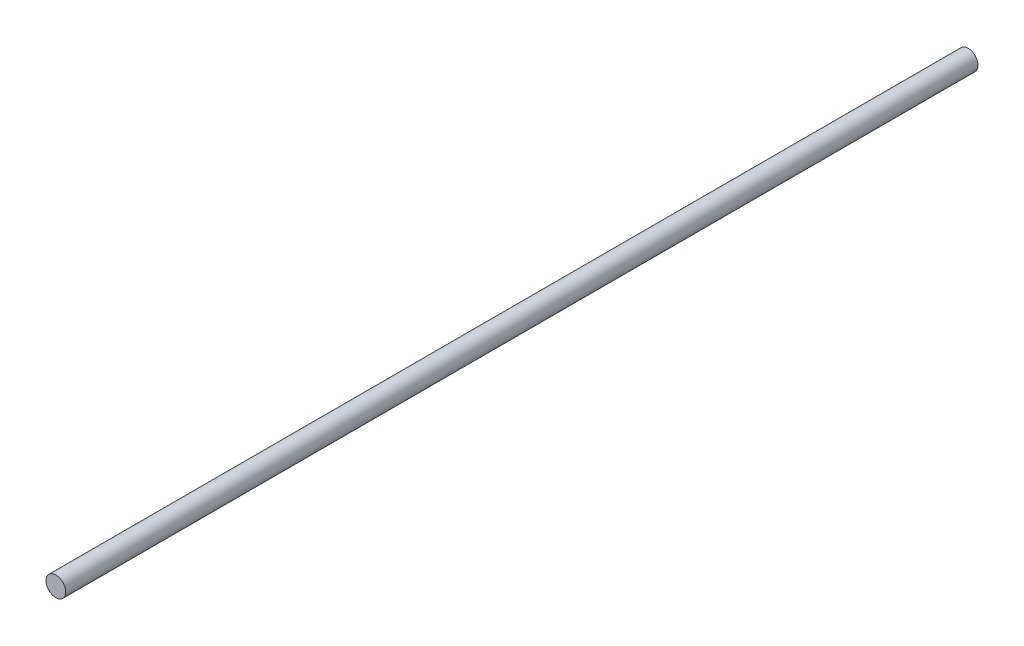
from build123d import *

# Parameters (mm, degrees)
CROQUIS1_R              = 4
SALIENTE_EXTRUIR1_DEPTH = 370


with BuildPart() as part:
    # Croquis1 → Saliente-Extruir1 (new body)
    with BuildSketch(Plane.XY):
        Circle(CROQUIS1_R)
    extrude(amount=SALIENTE_EXTRUIR1_DEPTH)


solid = part.part
